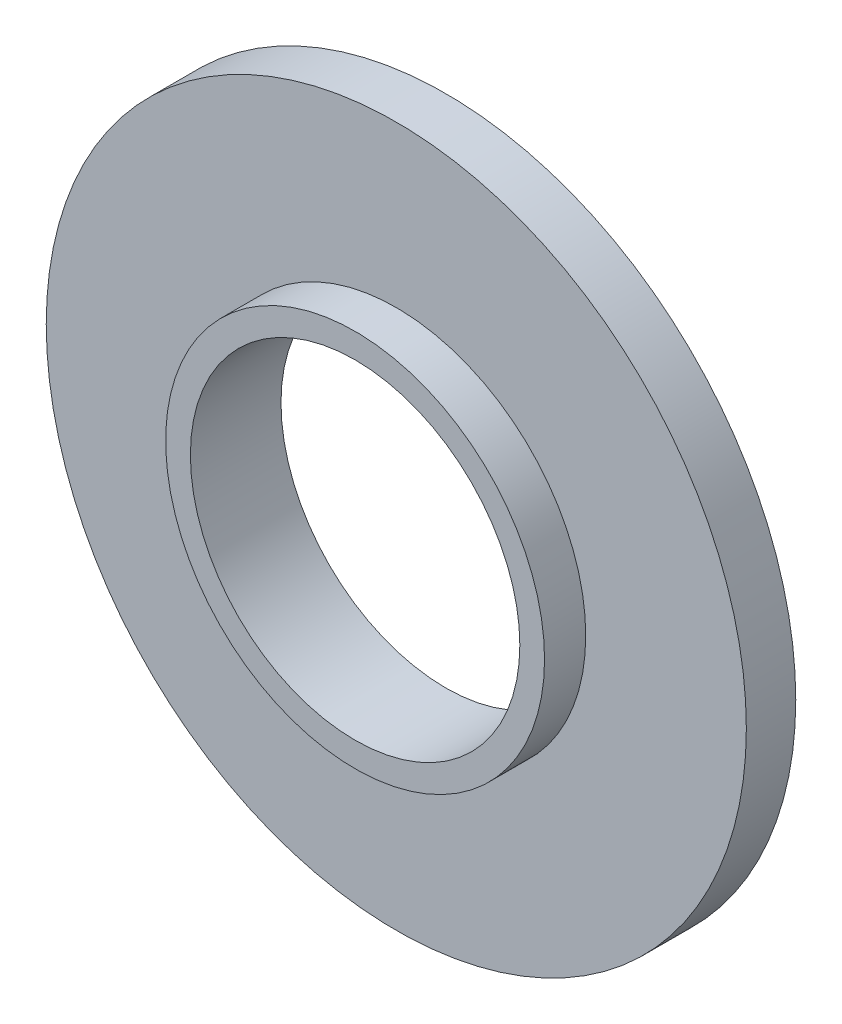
from build123d import *

# Parameters (mm, degrees)
SKETCH1_R           = 8.5
SKETCH1_R_2         = 4
BOSS_EXTRUDE1_DEPTH = 1.2
SKETCH2_R           = 4.6
SKETCH2_R_2         = 4
BOSS_EXTRUDE2_DEPTH = 1


with BuildPart() as part:
    # Sketch1 → Boss-Extrude1 (new body)
    with BuildSketch(Plane.XY):
        Circle(SKETCH1_R)
        Circle(SKETCH1_R_2, mode=Mode.SUBTRACT)
    extrude(amount=BOSS_EXTRUDE1_DEPTH)

    # Sketch2 → Boss-Extrude2 (add)
    with BuildSketch(Plane.XY.offset(1.2)):
        Circle(SKETCH2_R)
        Circle(SKETCH2_R_2, mode=Mode.SUBTRACT)
    extrude(amount=BOSS_EXTRUDE2_DEPTH)


solid = part.part
